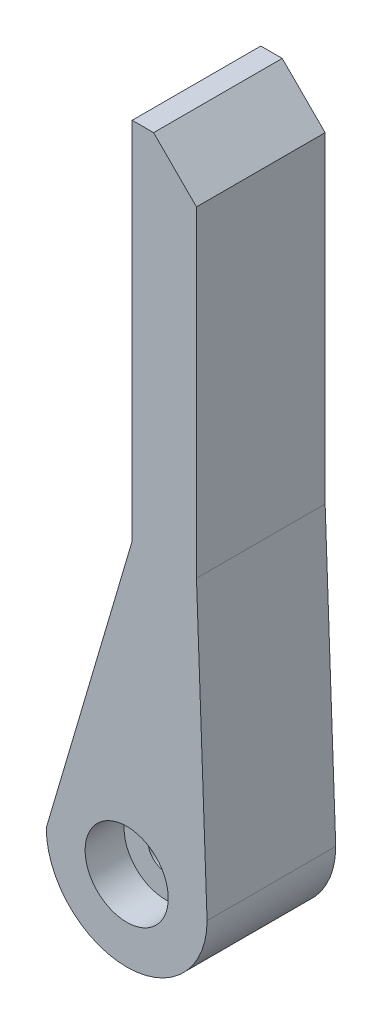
from build123d import *

# Parameters (mm, degrees)
BOSS_EXTRUDE1_DEPTH = 7.62


with BuildPart() as part:
    # Sketch1 → Boss-Extrude1 (new body)
    with BuildSketch(Plane.XY.offset(17.78)):
        with BuildLine():
            Line((-9.906, 26.67), (-9.906, 45.72))
            Line((-9.906, 45.72), (-12.446, 48.26))
            Line((-12.446, 48.26), (-13.716, 48.26))
            Line((-13.716, 48.26), (-13.716, 26.67))
            Line((-13.716, 26.67), (-18.8035057, 9.4199964))
            ThreePointArc((-18.8035057, 9.4199964), (-14.0410057, 4.6574964), (-9.2785057, 9.4199964))
            Line((-9.2785057, 9.4199964), (-9.906, 26.67))
        make_face()
    extrude(amount=-BOSS_EXTRUDE1_DEPTH)

    # Sketch2 → Cut-Revolve1 (revolve, cut)
    with BuildSketch(Plane.XZ.offset(-9.4199964), mode=Mode.PRIVATE) as cut_revolve1_sk:
        Polygon((-11.5772057, 17.78), (-14.0410057, 17.78), (-14.0410057, 10.16), (-11.5772057, 10.16), (-11.5772057, 12.9337562), (-12.9996057, 12.9337562), (-12.9996057, 15.4737562), (-11.5772057, 15.4737562), align=None)
    revolve(cut_revolve1_sk.sketch.rotate(Axis((-14.0410057, 9.4199964, 17.78), (0, 0, -1)), 180), axis=Axis((-14.0410057, 9.4199964, 17.78), (0, 0, -1)), mode=Mode.SUBTRACT)


solid = part.part
